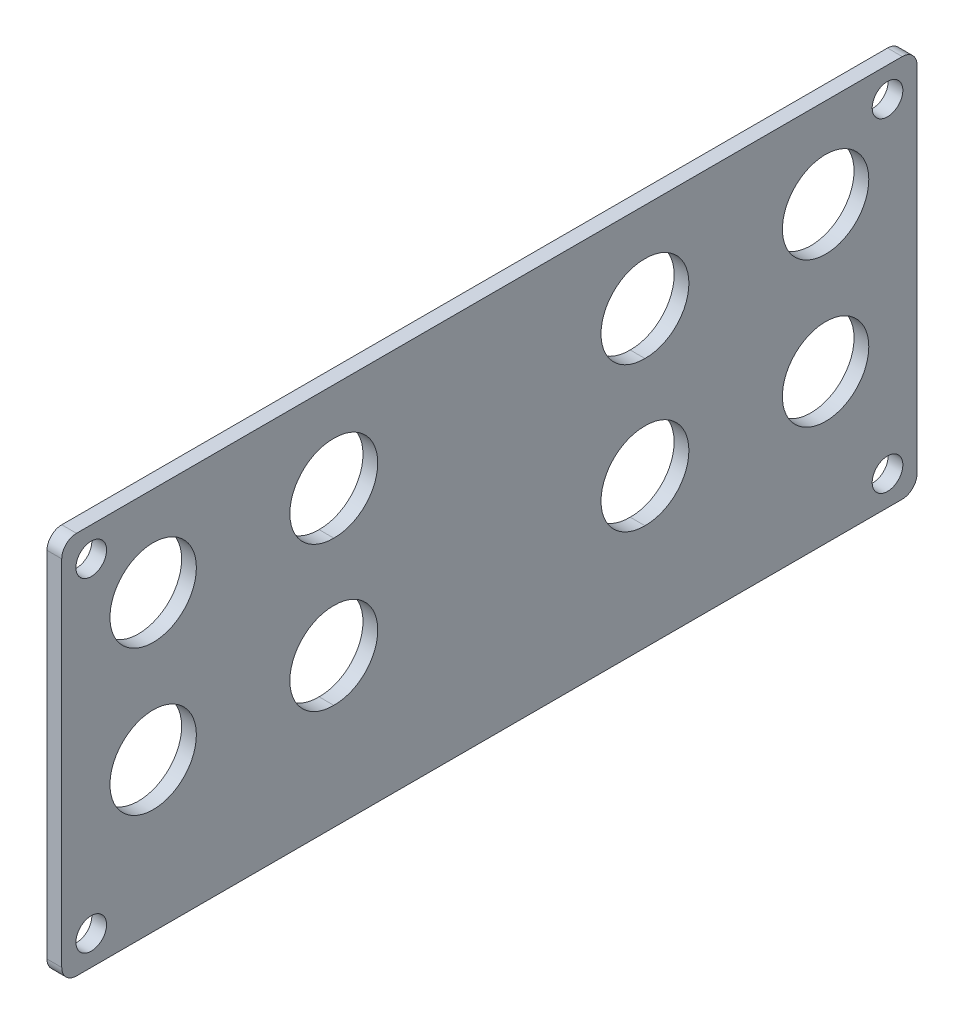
ISO-10303-21;
HEADER;
FILE_DESCRIPTION(('STEP AP214'),'2;1');
FILE_NAME('part.step','',(''),(''),'','','');
FILE_SCHEMA(('AUTOMOTIVE_DESIGN { 1 0 10303 214 1 1 1 1 }'));
ENDSEC;
DATA;
#1=APPLICATION_CONTEXT('core data for automotive mechanical design processes');
#2=APPLICATION_PROTOCOL_DEFINITION('international standard','automotive_design',2000,#1);
#3=PRODUCT_CONTEXT('',#1,'mechanical');
#4=PRODUCT('Part','Part','',(#3));
#5=PRODUCT_RELATED_PRODUCT_CATEGORY('part','',(#4));
#6=PRODUCT_DEFINITION_FORMATION('','',#4);
#7=PRODUCT_DEFINITION_CONTEXT('part definition',#1,'design');
#8=PRODUCT_DEFINITION('design','',#6,#7);
#9=PRODUCT_DEFINITION_SHAPE('','',#8);
#10=(LENGTH_UNIT() NAMED_UNIT(*) SI_UNIT(.MILLI.,.METRE.));
#11=(NAMED_UNIT(*) PLANE_ANGLE_UNIT() SI_UNIT($,.RADIAN.));
#12=(NAMED_UNIT(*) SI_UNIT($,.STERADIAN.) SOLID_ANGLE_UNIT());
#13=UNCERTAINTY_MEASURE_WITH_UNIT(LENGTH_MEASURE(1.E-05),#10,'distance_accuracy_value','');
#14=(GEOMETRIC_REPRESENTATION_CONTEXT(3) GLOBAL_UNCERTAINTY_ASSIGNED_CONTEXT((#13)) GLOBAL_UNIT_ASSIGNED_CONTEXT((#10,
#11,#12)) REPRESENTATION_CONTEXT('',''));
#15=CARTESIAN_POINT('',(0.,0.,0.));
#16=DIRECTION('',(0.,0.,1.));
#17=DIRECTION('',(1.,0.,0.));
#18=AXIS2_PLACEMENT_3D('',#15,#16,#17);
#19=CARTESIAN_POINT('',(-33.450675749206,0.,0.));
#20=DIRECTION('',(1.,0.,0.));
#21=DIRECTION('',(0.,0.,-1.));
#22=AXIS2_PLACEMENT_3D('',#19,#20,#21);
#23=PLANE('',#22);
#24=CARTESIAN_POINT('',(-33.450675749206,-61.389219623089,-21.0448330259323));
#25=DIRECTION('',(-1.,0.,0.));
#26=DIRECTION('',(0.,0.,1.));
#27=AXIS2_PLACEMENT_3D('',#24,#25,#26);
#28=CIRCLE('',#27,3.7211);
#29=CARTESIAN_POINT('',(-33.450675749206,-57.6686614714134,-20.9813330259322));
#30=VERTEX_POINT('',#29);
#31=CARTESIAN_POINT('',(-33.450675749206,-65.1097777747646,-20.9813330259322));
#32=VERTEX_POINT('',#31);
#33=EDGE_CURVE('E164',#30,#32,#28,.T.);
#34=ORIENTED_EDGE('',*,*,#33,.F.);
#35=CARTESIAN_POINT('',(-33.450675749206,-61.389219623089,-20.917833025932));
#36=DIRECTION('',(1.,0.,0.));
#37=DIRECTION('',(0.,0.,-1.));
#38=AXIS2_PLACEMENT_3D('',#35,#36,#37);
#39=CIRCLE('',#38,3.7211);
#40=EDGE_CURVE('E172',#30,#32,#39,.T.);
#41=ORIENTED_EDGE('',*,*,#40,.T.);
#42=EDGE_LOOP('',(#34,#41));
#43=FACE_BOUND('',#42,.T.);
#44=CARTESIAN_POINT('',(-33.450675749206,-48.917819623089,-47.8418330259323));
#45=DIRECTION('',(-1.,0.,0.));
#46=DIRECTION('',(0.,0.,1.));
#47=AXIS2_PLACEMENT_3D('',#44,#45,#46);
#48=CIRCLE('',#47,3.7211);
#49=CARTESIAN_POINT('',(-33.450675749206,-45.1972614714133,-47.7783330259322));
#50=VERTEX_POINT('',#49);
#51=CARTESIAN_POINT('',(-33.450675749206,-52.6383777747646,-47.7783330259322));
#52=VERTEX_POINT('',#51);
#53=EDGE_CURVE('E64',#50,#52,#48,.T.);
#54=ORIENTED_EDGE('',*,*,#53,.F.);
#55=CARTESIAN_POINT('',(-33.450675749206,-48.917819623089,-47.714833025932));
#56=DIRECTION('',(1.,0.,0.));
#57=DIRECTION('',(0.,0.,-1.));
#58=AXIS2_PLACEMENT_3D('',#55,#56,#57);
#59=CIRCLE('',#58,3.7211);
#60=EDGE_CURVE('E369',#50,#52,#59,.T.);
#61=ORIENTED_EDGE('',*,*,#60,.T.);
#62=EDGE_LOOP('',(#54,#61));
#63=FACE_BOUND('',#62,.T.);
#64=CARTESIAN_POINT('',(-33.450675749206,-48.917819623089,-63.335833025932));
#65=DIRECTION('',(1.,0.,0.));
#66=DIRECTION('',(0.,0.,-1.));
#67=AXIS2_PLACEMENT_3D('',#64,#65,#66);
#68=CIRCLE('',#67,3.7211);
#69=CARTESIAN_POINT('',(-33.450675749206,-48.917819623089,-67.056933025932));
#70=VERTEX_POINT('',#69);
#71=EDGE_CURVE('E361',#70,#70,#68,.T.);
#72=ORIENTED_EDGE('',*,*,#71,.T.);
#73=EDGE_LOOP('',(#72));
#74=FACE_BOUND('',#73,.T.);
#75=CARTESIAN_POINT('',(-33.450675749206,-61.389219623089,-5.42383302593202));
#76=DIRECTION('',(1.,0.,0.));
#77=DIRECTION('',(0.,0.,-1.));
#78=AXIS2_PLACEMENT_3D('',#75,#76,#77);
#79=CIRCLE('',#78,3.7211);
#80=CARTESIAN_POINT('',(-33.450675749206,-61.389219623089,-9.14493302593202));
#81=VERTEX_POINT('',#80);
#82=EDGE_CURVE('E179',#81,#81,#79,.T.);
#83=ORIENTED_EDGE('',*,*,#82,.T.);
#84=EDGE_LOOP('',(#83));
#85=FACE_BOUND('',#84,.T.);
#86=CARTESIAN_POINT('',(-33.450675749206,-48.917819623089,-5.42383302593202));
#87=DIRECTION('',(1.,0.,0.));
#88=DIRECTION('',(0.,0.,-1.));
#89=AXIS2_PLACEMENT_3D('',#86,#87,#88);
#90=CIRCLE('',#89,3.7211);
#91=CARTESIAN_POINT('',(-33.450675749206,-48.917819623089,-9.14493302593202));
#92=VERTEX_POINT('',#91);
#93=EDGE_CURVE('E344',#92,#92,#90,.T.);
#94=ORIENTED_EDGE('',*,*,#93,.T.);
#95=EDGE_LOOP('',(#94));
#96=FACE_BOUND('',#95,.T.);
#97=CARTESIAN_POINT('',(-33.450675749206,-61.389219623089,-63.335833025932));
#98=DIRECTION('',(1.,0.,0.));
#99=DIRECTION('',(0.,0.,-1.));
#100=AXIS2_PLACEMENT_3D('',#97,#98,#99);
#101=CIRCLE('',#100,3.7211);
#102=CARTESIAN_POINT('',(-33.450675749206,-61.389219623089,-67.056933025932));
#103=VERTEX_POINT('',#102);
#104=EDGE_CURVE('E190',#103,#103,#101,.T.);
#105=ORIENTED_EDGE('',*,*,#104,.T.);
#106=EDGE_LOOP('',(#105));
#107=FACE_BOUND('',#106,.T.);
#108=CARTESIAN_POINT('',(-33.450675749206,-71.676219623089,-0.0898330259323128));
#109=DIRECTION('',(1.,0.,0.));
#110=DIRECTION('',(0.,0.,1.));
#111=AXIS2_PLACEMENT_3D('',#108,#109,#110);
#112=CIRCLE('',#111,1.32079999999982);
#113=CARTESIAN_POINT('',(-33.450675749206,-71.676219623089,1.2309669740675));
#114=VERTEX_POINT('',#113);
#115=EDGE_CURVE('E200',#114,#114,#112,.T.);
#116=ORIENTED_EDGE('',*,*,#115,.T.);
#117=EDGE_LOOP('',(#116));
#118=FACE_BOUND('',#117,.T.);
#119=CARTESIAN_POINT('',(-33.450675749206,-43.736219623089,-0.0898330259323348));
#120=DIRECTION('',(1.,0.,0.));
#121=DIRECTION('',(0.,0.,1.));
#122=AXIS2_PLACEMENT_3D('',#119,#120,#121);
#123=CIRCLE('',#122,1.3207999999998);
#124=CARTESIAN_POINT('',(-33.450675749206,-43.736219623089,1.23096697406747));
#125=VERTEX_POINT('',#124);
#126=EDGE_CURVE('E208',#125,#125,#123,.T.);
#127=ORIENTED_EDGE('',*,*,#126,.T.);
#128=EDGE_LOOP('',(#127));
#129=FACE_BOUND('',#128,.T.);
#130=CARTESIAN_POINT('',(-33.450675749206,-43.736219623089,-68.669833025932));
#131=DIRECTION('',(1.,0.,0.));
#132=DIRECTION('',(0.,0.,1.));
#133=AXIS2_PLACEMENT_3D('',#130,#131,#132);
#134=CIRCLE('',#133,1.32079999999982);
#135=CARTESIAN_POINT('',(-33.450675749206,-43.736219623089,-67.3490330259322));
#136=VERTEX_POINT('',#135);
#137=EDGE_CURVE('E216',#136,#136,#134,.T.);
#138=ORIENTED_EDGE('',*,*,#137,.T.);
#139=EDGE_LOOP('',(#138));
#140=FACE_BOUND('',#139,.T.);
#141=CARTESIAN_POINT('',(-33.450675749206,-71.676219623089,-68.669833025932));
#142=DIRECTION('',(1.,0.,0.));
#143=DIRECTION('',(0.,0.,1.));
#144=AXIS2_PLACEMENT_3D('',#141,#142,#143);
#145=CIRCLE('',#144,1.32079999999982);
#146=CARTESIAN_POINT('',(-33.450675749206,-71.676219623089,-67.3490330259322));
#147=VERTEX_POINT('',#146);
#148=EDGE_CURVE('E224',#147,#147,#145,.T.);
#149=ORIENTED_EDGE('',*,*,#148,.T.);
#150=EDGE_LOOP('',(#149));
#151=FACE_BOUND('',#150,.T.);
#152=DIRECTION('',(0.,0.,-1.));
#153=VECTOR('',#152,1.);
#154=CARTESIAN_POINT('',(-33.450675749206,-74.216219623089,2.45016697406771));
#155=LINE('',#154,#153);
#156=CARTESIAN_POINT('',(-33.450675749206,-74.216219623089,1.18016697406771));
#157=VERTEX_POINT('',#156);
#158=CARTESIAN_POINT('',(-33.450675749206,-74.216219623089,-69.939833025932));
#159=VERTEX_POINT('',#158);
#160=EDGE_CURVE('E245',#157,#159,#155,.T.);
#161=ORIENTED_EDGE('',*,*,#160,.F.);
#162=CARTESIAN_POINT('',(-33.450675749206,-72.946219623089,1.18016697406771));
#163=DIRECTION('',(1.,0.,0.));
#164=DIRECTION('',(0.,0.,-1.));
#165=AXIS2_PLACEMENT_3D('',#162,#163,#164);
#166=CIRCLE('',#165,1.27);
#167=CARTESIAN_POINT('',(-33.450675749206,-72.946219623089,2.45016697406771));
#168=VERTEX_POINT('',#167);
#169=EDGE_CURVE('E298',#157,#168,#166,.F.);
#170=ORIENTED_EDGE('',*,*,#169,.T.);
#171=DIRECTION('',(0.,-1.,0.));
#172=VECTOR('',#171,1.);
#173=CARTESIAN_POINT('',(-33.450675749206,-41.196219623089,2.45016697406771));
#174=LINE('',#173,#172);
#175=CARTESIAN_POINT('',(-33.450675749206,-42.466219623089,2.45016697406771));
#176=VERTEX_POINT('',#175);
#177=EDGE_CURVE('E241',#176,#168,#174,.T.);
#178=ORIENTED_EDGE('',*,*,#177,.F.);
#179=CARTESIAN_POINT('',(-33.450675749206,-42.466219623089,1.18016697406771));
#180=DIRECTION('',(1.,0.,0.));
#181=DIRECTION('',(0.,0.,-1.));
#182=AXIS2_PLACEMENT_3D('',#179,#180,#181);
#183=CIRCLE('',#182,1.27);
#184=CARTESIAN_POINT('',(-33.450675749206,-41.196219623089,1.18016697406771));
#185=VERTEX_POINT('',#184);
#186=EDGE_CURVE('E292',#176,#185,#183,.F.);
#187=ORIENTED_EDGE('',*,*,#186,.T.);
#188=DIRECTION('',(0.,0.,1.));
#189=VECTOR('',#188,1.);
#190=CARTESIAN_POINT('',(-33.450675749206,-41.196219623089,-71.209833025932));
#191=LINE('',#190,#189);
#192=CARTESIAN_POINT('',(-33.450675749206,-41.196219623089,-69.939833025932));
#193=VERTEX_POINT('',#192);
#194=EDGE_CURVE('E236',#193,#185,#191,.T.);
#195=ORIENTED_EDGE('',*,*,#194,.F.);
#196=CARTESIAN_POINT('',(-33.450675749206,-42.466219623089,-69.939833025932));
#197=DIRECTION('',(1.,0.,0.));
#198=DIRECTION('',(0.,0.,-1.));
#199=AXIS2_PLACEMENT_3D('',#196,#197,#198);
#200=CIRCLE('',#199,1.27);
#201=CARTESIAN_POINT('',(-33.450675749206,-42.466219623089,-71.209833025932));
#202=VERTEX_POINT('',#201);
#203=EDGE_CURVE('E289',#193,#202,#200,.F.);
#204=ORIENTED_EDGE('',*,*,#203,.T.);
#205=DIRECTION('',(0.,1.,0.));
#206=VECTOR('',#205,1.);
#207=CARTESIAN_POINT('',(-33.450675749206,-74.216219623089,-71.209833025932));
#208=LINE('',#207,#206);
#209=CARTESIAN_POINT('',(-33.450675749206,-72.946219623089,-71.209833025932));
#210=VERTEX_POINT('',#209);
#211=EDGE_CURVE('E232',#210,#202,#208,.T.);
#212=ORIENTED_EDGE('',*,*,#211,.F.);
#213=CARTESIAN_POINT('',(-33.450675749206,-72.946219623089,-69.939833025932));
#214=DIRECTION('',(1.,0.,0.));
#215=DIRECTION('',(0.,0.,-1.));
#216=AXIS2_PLACEMENT_3D('',#213,#214,#215);
#217=CIRCLE('',#216,1.27);
#218=EDGE_CURVE('E295',#210,#159,#217,.F.);
#219=ORIENTED_EDGE('',*,*,#218,.T.);
#220=EDGE_LOOP('',(#161,#170,#178,#187,#195,#204,#212,#219));
#221=FACE_BOUND('',#220,.T.);
#222=CARTESIAN_POINT('',(-33.450675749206,-48.917819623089,-21.0448330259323));
#223=DIRECTION('',(-1.,0.,0.));
#224=DIRECTION('',(0.,0.,1.));
#225=AXIS2_PLACEMENT_3D('',#222,#223,#224);
#226=CIRCLE('',#225,3.7211);
#227=CARTESIAN_POINT('',(-33.450675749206,-45.1972614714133,-20.9813330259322));
#228=VERTEX_POINT('',#227);
#229=CARTESIAN_POINT('',(-33.450675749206,-52.6383777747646,-20.9813330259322));
#230=VERTEX_POINT('',#229);
#231=EDGE_CURVE('E56',#228,#230,#226,.T.);
#232=ORIENTED_EDGE('',*,*,#231,.F.);
#233=CARTESIAN_POINT('',(-33.450675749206,-48.917819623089,-20.917833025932));
#234=DIRECTION('',(1.,0.,0.));
#235=DIRECTION('',(0.,0.,-1.));
#236=AXIS2_PLACEMENT_3D('',#233,#234,#235);
#237=CIRCLE('',#236,3.7211);
#238=EDGE_CURVE('E343',#228,#230,#237,.T.);
#239=ORIENTED_EDGE('',*,*,#238,.T.);
#240=EDGE_LOOP('',(#232,#239));
#241=FACE_BOUND('',#240,.T.);
#242=CARTESIAN_POINT('',(-33.450675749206,-61.389219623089,-47.8418330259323));
#243=DIRECTION('',(-1.,0.,0.));
#244=DIRECTION('',(0.,0.,1.));
#245=AXIS2_PLACEMENT_3D('',#242,#243,#244);
#246=CIRCLE('',#245,3.7211);
#247=CARTESIAN_POINT('',(-33.450675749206,-57.6686614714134,-47.7783330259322));
#248=VERTEX_POINT('',#247);
#249=CARTESIAN_POINT('',(-33.450675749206,-65.1097777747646,-47.7783330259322));
#250=VERTEX_POINT('',#249);
#251=EDGE_CURVE('E165',#248,#250,#246,.T.);
#252=ORIENTED_EDGE('',*,*,#251,.F.);
#253=CARTESIAN_POINT('',(-33.450675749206,-61.389219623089,-47.714833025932));
#254=DIRECTION('',(1.,0.,0.));
#255=DIRECTION('',(0.,0.,-1.));
#256=AXIS2_PLACEMENT_3D('',#253,#254,#255);
#257=CIRCLE('',#256,3.7211);
#258=EDGE_CURVE('E199',#248,#250,#257,.T.);
#259=ORIENTED_EDGE('',*,*,#258,.T.);
#260=EDGE_LOOP('',(#252,#259));
#261=FACE_BOUND('',#260,.T.);
#262=ADVANCED_FACE('F41',(#43,#63,#74,#85,#96,#107,#118,#129,#140,#151,#221,#241,#261),#23,.F.);
#263=CARTESIAN_POINT('',(-32.180675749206,0.,0.));
#264=DIRECTION('',(1.,0.,0.));
#265=DIRECTION('',(0.,0.,-1.));
#266=AXIS2_PLACEMENT_3D('',#263,#264,#265);
#267=PLANE('',#266);
#268=CARTESIAN_POINT('',(-32.180675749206,-48.917819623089,-63.335833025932));
#269=DIRECTION('',(1.,0.,0.));
#270=DIRECTION('',(0.,0.,-1.));
#271=AXIS2_PLACEMENT_3D('',#268,#269,#270);
#272=CIRCLE('',#271,3.7211);
#273=CARTESIAN_POINT('',(-32.180675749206,-48.917819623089,-67.056933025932));
#274=VERTEX_POINT('',#273);
#275=EDGE_CURVE('E365',#274,#274,#272,.T.);
#276=ORIENTED_EDGE('',*,*,#275,.F.);
#277=EDGE_LOOP('',(#276));
#278=FACE_BOUND('',#277,.T.);
#279=CARTESIAN_POINT('',(-32.180675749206,-61.389219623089,-5.42383302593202));
#280=DIRECTION('',(1.,0.,0.));
#281=DIRECTION('',(0.,0.,-1.));
#282=AXIS2_PLACEMENT_3D('',#279,#280,#281);
#283=CIRCLE('',#282,3.7211);
#284=CARTESIAN_POINT('',(-32.180675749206,-61.389219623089,-9.14493302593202));
#285=VERTEX_POINT('',#284);
#286=EDGE_CURVE('E186',#285,#285,#283,.T.);
#287=ORIENTED_EDGE('',*,*,#286,.F.);
#288=EDGE_LOOP('',(#287));
#289=FACE_BOUND('',#288,.T.);
#290=CARTESIAN_POINT('',(-32.180675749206,-48.917819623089,-5.42383302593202));
#291=DIRECTION('',(1.,0.,0.));
#292=DIRECTION('',(0.,0.,-1.));
#293=AXIS2_PLACEMENT_3D('',#290,#291,#292);
#294=CIRCLE('',#293,3.7211);
#295=CARTESIAN_POINT('',(-32.180675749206,-48.917819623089,-9.14493302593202));
#296=VERTEX_POINT('',#295);
#297=EDGE_CURVE('E351',#296,#296,#294,.T.);
#298=ORIENTED_EDGE('',*,*,#297,.F.);
#299=EDGE_LOOP('',(#298));
#300=FACE_BOUND('',#299,.T.);
#301=CARTESIAN_POINT('',(-32.180675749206,-61.389219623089,-63.335833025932));
#302=DIRECTION('',(1.,0.,0.));
#303=DIRECTION('',(0.,0.,-1.));
#304=AXIS2_PLACEMENT_3D('',#301,#302,#303);
#305=CIRCLE('',#304,3.7211);
#306=CARTESIAN_POINT('',(-32.180675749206,-61.389219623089,-67.056933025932));
#307=VERTEX_POINT('',#306);
#308=EDGE_CURVE('E195',#307,#307,#305,.T.);
#309=ORIENTED_EDGE('',*,*,#308,.F.);
#310=EDGE_LOOP('',(#309));
#311=FACE_BOUND('',#310,.T.);
#312=CARTESIAN_POINT('',(-32.180675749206,-71.676219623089,-0.0898330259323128));
#313=DIRECTION('',(1.,0.,0.));
#314=DIRECTION('',(0.,0.,1.));
#315=AXIS2_PLACEMENT_3D('',#312,#313,#314);
#316=CIRCLE('',#315,1.32079999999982);
#317=CARTESIAN_POINT('',(-32.180675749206,-71.676219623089,1.2309669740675));
#318=VERTEX_POINT('',#317);
#319=EDGE_CURVE('E194',#318,#318,#316,.T.);
#320=ORIENTED_EDGE('',*,*,#319,.F.);
#321=EDGE_LOOP('',(#320));
#322=FACE_BOUND('',#321,.T.);
#323=CARTESIAN_POINT('',(-32.180675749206,-43.736219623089,-0.0898330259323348));
#324=DIRECTION('',(1.,0.,0.));
#325=DIRECTION('',(0.,0.,1.));
#326=AXIS2_PLACEMENT_3D('',#323,#324,#325);
#327=CIRCLE('',#326,1.3207999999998);
#328=CARTESIAN_POINT('',(-32.180675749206,-43.736219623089,1.23096697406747));
#329=VERTEX_POINT('',#328);
#330=EDGE_CURVE('E204',#329,#329,#327,.T.);
#331=ORIENTED_EDGE('',*,*,#330,.F.);
#332=EDGE_LOOP('',(#331));
#333=FACE_BOUND('',#332,.T.);
#334=CARTESIAN_POINT('',(-32.180675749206,-43.736219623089,-68.669833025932));
#335=DIRECTION('',(1.,0.,0.));
#336=DIRECTION('',(0.,0.,1.));
#337=AXIS2_PLACEMENT_3D('',#334,#335,#336);
#338=CIRCLE('',#337,1.32079999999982);
#339=CARTESIAN_POINT('',(-32.180675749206,-43.736219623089,-67.3490330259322));
#340=VERTEX_POINT('',#339);
#341=EDGE_CURVE('E212',#340,#340,#338,.T.);
#342=ORIENTED_EDGE('',*,*,#341,.F.);
#343=EDGE_LOOP('',(#342));
#344=FACE_BOUND('',#343,.T.);
#345=CARTESIAN_POINT('',(-32.180675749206,-71.676219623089,-68.669833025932));
#346=DIRECTION('',(1.,0.,0.));
#347=DIRECTION('',(0.,0.,1.));
#348=AXIS2_PLACEMENT_3D('',#345,#346,#347);
#349=CIRCLE('',#348,1.32079999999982);
#350=CARTESIAN_POINT('',(-32.180675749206,-71.676219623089,-67.3490330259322));
#351=VERTEX_POINT('',#350);
#352=EDGE_CURVE('E220',#351,#351,#349,.T.);
#353=ORIENTED_EDGE('',*,*,#352,.F.);
#354=EDGE_LOOP('',(#353));
#355=FACE_BOUND('',#354,.T.);
#356=DIRECTION('',(0.,-1.,0.));
#357=VECTOR('',#356,1.);
#358=CARTESIAN_POINT('',(-32.180675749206,-41.196219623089,2.45016697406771));
#359=LINE('',#358,#357);
#360=CARTESIAN_POINT('',(-32.180675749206,-42.466219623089,2.45016697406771));
#361=VERTEX_POINT('',#360);
#362=CARTESIAN_POINT('',(-32.180675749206,-72.946219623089,2.45016697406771));
#363=VERTEX_POINT('',#362);
#364=EDGE_CURVE('E257',#361,#363,#359,.T.);
#365=ORIENTED_EDGE('',*,*,#364,.T.);
#366=CARTESIAN_POINT('',(-32.180675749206,-72.946219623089,1.18016697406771));
#367=DIRECTION('',(1.,0.,0.));
#368=DIRECTION('',(0.,0.,-1.));
#369=AXIS2_PLACEMENT_3D('',#366,#367,#368);
#370=CIRCLE('',#369,1.27);
#371=CARTESIAN_POINT('',(-32.180675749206,-74.216219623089,1.18016697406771));
#372=VERTEX_POINT('',#371);
#373=EDGE_CURVE('E279',#363,#372,#370,.T.);
#374=ORIENTED_EDGE('',*,*,#373,.T.);
#375=DIRECTION('',(0.,0.,-1.));
#376=VECTOR('',#375,1.);
#377=CARTESIAN_POINT('',(-32.180675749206,-74.216219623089,2.45016697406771));
#378=LINE('',#377,#376);
#379=CARTESIAN_POINT('',(-32.180675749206,-74.216219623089,-69.939833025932));
#380=VERTEX_POINT('',#379);
#381=EDGE_CURVE('E237',#372,#380,#378,.T.);
#382=ORIENTED_EDGE('',*,*,#381,.T.);
#383=CARTESIAN_POINT('',(-32.180675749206,-72.946219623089,-69.939833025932));
#384=DIRECTION('',(1.,0.,0.));
#385=DIRECTION('',(0.,0.,-1.));
#386=AXIS2_PLACEMENT_3D('',#383,#384,#385);
#387=CIRCLE('',#386,1.27);
#388=CARTESIAN_POINT('',(-32.180675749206,-72.946219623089,-71.209833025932));
#389=VERTEX_POINT('',#388);
#390=EDGE_CURVE('E276',#380,#389,#387,.T.);
#391=ORIENTED_EDGE('',*,*,#390,.T.);
#392=DIRECTION('',(0.,1.,0.));
#393=VECTOR('',#392,1.);
#394=CARTESIAN_POINT('',(-32.180675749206,-74.216219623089,-71.209833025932));
#395=LINE('',#394,#393);
#396=CARTESIAN_POINT('',(-32.180675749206,-42.466219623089,-71.209833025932));
#397=VERTEX_POINT('',#396);
#398=EDGE_CURVE('E228',#389,#397,#395,.T.);
#399=ORIENTED_EDGE('',*,*,#398,.T.);
#400=CARTESIAN_POINT('',(-32.180675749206,-42.466219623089,-69.939833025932));
#401=DIRECTION('',(1.,0.,0.));
#402=DIRECTION('',(0.,0.,-1.));
#403=AXIS2_PLACEMENT_3D('',#400,#401,#402);
#404=CIRCLE('',#403,1.27);
#405=CARTESIAN_POINT('',(-32.180675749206,-41.196219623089,-69.939833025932));
#406=VERTEX_POINT('',#405);
#407=EDGE_CURVE('E270',#397,#406,#404,.T.);
#408=ORIENTED_EDGE('',*,*,#407,.T.);
#409=DIRECTION('',(0.,0.,1.));
#410=VECTOR('',#409,1.);
#411=CARTESIAN_POINT('',(-32.180675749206,-41.196219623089,-71.209833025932));
#412=LINE('',#411,#410);
#413=CARTESIAN_POINT('',(-32.180675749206,-41.196219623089,1.18016697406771));
#414=VERTEX_POINT('',#413);
#415=EDGE_CURVE('E253',#406,#414,#412,.T.);
#416=ORIENTED_EDGE('',*,*,#415,.T.);
#417=CARTESIAN_POINT('',(-32.180675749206,-42.466219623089,1.18016697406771));
#418=DIRECTION('',(1.,0.,0.));
#419=DIRECTION('',(0.,0.,-1.));
#420=AXIS2_PLACEMENT_3D('',#417,#418,#419);
#421=CIRCLE('',#420,1.27);
#422=EDGE_CURVE('E273',#414,#361,#421,.T.);
#423=ORIENTED_EDGE('',*,*,#422,.T.);
#424=EDGE_LOOP('',(#365,#374,#382,#391,#399,#408,#416,#423));
#425=FACE_BOUND('',#424,.T.);
#426=CARTESIAN_POINT('',(-32.180675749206,-48.917819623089,-47.714833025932));
#427=DIRECTION('',(1.,0.,0.));
#428=DIRECTION('',(0.,0.,-1.));
#429=AXIS2_PLACEMENT_3D('',#426,#427,#428);
#430=CIRCLE('',#429,3.7211);
#431=CARTESIAN_POINT('',(-32.180675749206,-45.1972614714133,-47.7783330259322));
#432=VERTEX_POINT('',#431);
#433=CARTESIAN_POINT('',(-32.180675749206,-52.6383777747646,-47.7783330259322));
#434=VERTEX_POINT('',#433);
#435=EDGE_CURVE('E348',#432,#434,#430,.T.);
#436=ORIENTED_EDGE('',*,*,#435,.F.);
#437=CARTESIAN_POINT('',(-32.180675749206,-48.917819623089,-47.8418330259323));
#438=DIRECTION('',(-1.,0.,0.));
#439=DIRECTION('',(0.,0.,1.));
#440=AXIS2_PLACEMENT_3D('',#437,#438,#439);
#441=CIRCLE('',#440,3.7211);
#442=EDGE_CURVE('E401',#432,#434,#441,.T.);
#443=ORIENTED_EDGE('',*,*,#442,.T.);
#444=EDGE_LOOP('',(#436,#443));
#445=FACE_BOUND('',#444,.T.);
#446=CARTESIAN_POINT('',(-32.180675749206,-48.917819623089,-20.917833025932));
#447=DIRECTION('',(1.,0.,0.));
#448=DIRECTION('',(0.,0.,-1.));
#449=AXIS2_PLACEMENT_3D('',#446,#447,#448);
#450=CIRCLE('',#449,3.7211);
#451=CARTESIAN_POINT('',(-32.180675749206,-45.1972614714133,-20.9813330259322));
#452=VERTEX_POINT('',#451);
#453=CARTESIAN_POINT('',(-32.180675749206,-52.6383777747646,-20.9813330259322));
#454=VERTEX_POINT('',#453);
#455=EDGE_CURVE('E338',#452,#454,#450,.T.);
#456=ORIENTED_EDGE('',*,*,#455,.F.);
#457=CARTESIAN_POINT('',(-32.180675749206,-48.917819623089,-21.0448330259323));
#458=DIRECTION('',(-1.,0.,0.));
#459=DIRECTION('',(0.,0.,1.));
#460=AXIS2_PLACEMENT_3D('',#457,#458,#459);
#461=CIRCLE('',#460,3.7211);
#462=EDGE_CURVE('E330',#452,#454,#461,.T.);
#463=ORIENTED_EDGE('',*,*,#462,.T.);
#464=EDGE_LOOP('',(#456,#463));
#465=FACE_BOUND('',#464,.T.);
#466=CARTESIAN_POINT('',(-32.180675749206,-61.389219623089,-20.917833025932));
#467=DIRECTION('',(1.,0.,0.));
#468=DIRECTION('',(0.,0.,-1.));
#469=AXIS2_PLACEMENT_3D('',#466,#467,#468);
#470=CIRCLE('',#469,3.7211);
#471=CARTESIAN_POINT('',(-32.180675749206,-57.6686614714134,-20.9813330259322));
#472=VERTEX_POINT('',#471);
#473=CARTESIAN_POINT('',(-32.180675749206,-65.1097777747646,-20.9813330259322));
#474=VERTEX_POINT('',#473);
#475=EDGE_CURVE('E170',#472,#474,#470,.T.);
#476=ORIENTED_EDGE('',*,*,#475,.F.);
#477=CARTESIAN_POINT('',(-32.180675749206,-61.389219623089,-21.0448330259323));
#478=DIRECTION('',(-1.,0.,0.));
#479=DIRECTION('',(0.,0.,1.));
#480=AXIS2_PLACEMENT_3D('',#477,#478,#479);
#481=CIRCLE('',#480,3.7211);
#482=EDGE_CURVE('E153',#472,#474,#481,.T.);
#483=ORIENTED_EDGE('',*,*,#482,.T.);
#484=EDGE_LOOP('',(#476,#483));
#485=FACE_BOUND('',#484,.T.);
#486=CARTESIAN_POINT('',(-32.180675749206,-61.389219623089,-47.714833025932));
#487=DIRECTION('',(1.,0.,0.));
#488=DIRECTION('',(0.,0.,-1.));
#489=AXIS2_PLACEMENT_3D('',#486,#487,#488);
#490=CIRCLE('',#489,3.7211);
#491=CARTESIAN_POINT('',(-32.180675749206,-57.6686614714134,-47.7783330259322));
#492=VERTEX_POINT('',#491);
#493=CARTESIAN_POINT('',(-32.180675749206,-65.1097777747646,-47.7783330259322));
#494=VERTEX_POINT('',#493);
#495=EDGE_CURVE('E183',#492,#494,#490,.T.);
#496=ORIENTED_EDGE('',*,*,#495,.F.);
#497=CARTESIAN_POINT('',(-32.180675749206,-61.389219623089,-47.8418330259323));
#498=DIRECTION('',(-1.,0.,0.));
#499=DIRECTION('',(0.,0.,1.));
#500=AXIS2_PLACEMENT_3D('',#497,#498,#499);
#501=CIRCLE('',#500,3.7211);
#502=EDGE_CURVE('E381',#492,#494,#501,.T.);
#503=ORIENTED_EDGE('',*,*,#502,.T.);
#504=EDGE_LOOP('',(#496,#503));
#505=FACE_BOUND('',#504,.T.);
#506=ADVANCED_FACE('F176',(#278,#289,#300,#311,#322,#333,#344,#355,#425,#445,#465,#485,#505),
#267,.T.);
#507=CARTESIAN_POINT('',(-33.450675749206,-48.917819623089,-20.917833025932));
#508=DIRECTION('',(1.,0.,0.));
#509=DIRECTION('',(0.,0.,-1.));
#510=AXIS2_PLACEMENT_3D('',#507,#508,#509);
#511=CYLINDRICAL_SURFACE('',#510,3.7211);
#512=DIRECTION('',(1.,0.,0.));
#513=VECTOR('',#512,1.);
#514=CARTESIAN_POINT('',(-32.815675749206,-45.1972614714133,-20.9813330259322));
#515=LINE('',#514,#513);
#516=EDGE_CURVE('E11',#452,#228,#515,.F.);
#517=ORIENTED_EDGE('',*,*,#516,.F.);
#518=ORIENTED_EDGE('',*,*,#455,.T.);
#519=DIRECTION('',(1.,0.,0.));
#520=VECTOR('',#519,1.);
#521=CARTESIAN_POINT('',(-32.815675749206,-52.6383777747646,-20.9813330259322));
#522=LINE('',#521,#520);
#523=EDGE_CURVE('E50',#230,#454,#522,.T.);
#524=ORIENTED_EDGE('',*,*,#523,.F.);
#525=ORIENTED_EDGE('',*,*,#238,.F.);
#526=EDGE_LOOP('',(#517,#518,#524,#525));
#527=FACE_BOUND('',#526,.T.);
#528=ADVANCED_FACE('F341',(#527),#511,.F.);
#529=CARTESIAN_POINT('',(-33.450675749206,-48.917819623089,-47.714833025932));
#530=DIRECTION('',(1.,0.,0.));
#531=DIRECTION('',(0.,0.,-1.));
#532=AXIS2_PLACEMENT_3D('',#529,#530,#531);
#533=CYLINDRICAL_SURFACE('',#532,3.7211);
#534=DIRECTION('',(1.,0.,0.));
#535=VECTOR('',#534,1.);
#536=CARTESIAN_POINT('',(-32.815675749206,-45.1972614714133,-47.7783330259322));
#537=LINE('',#536,#535);
#538=EDGE_CURVE('E325',#432,#50,#537,.F.);
#539=ORIENTED_EDGE('',*,*,#538,.F.);
#540=ORIENTED_EDGE('',*,*,#435,.T.);
#541=DIRECTION('',(1.,0.,0.));
#542=VECTOR('',#541,1.);
#543=CARTESIAN_POINT('',(-32.815675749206,-52.6383777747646,-47.7783330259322));
#544=LINE('',#543,#542);
#545=EDGE_CURVE('E322',#52,#434,#544,.T.);
#546=ORIENTED_EDGE('',*,*,#545,.F.);
#547=ORIENTED_EDGE('',*,*,#60,.F.);
#548=EDGE_LOOP('',(#539,#540,#546,#547));
#549=FACE_BOUND('',#548,.T.);
#550=ADVANCED_FACE('F397',(#549),#533,.F.);
#551=CARTESIAN_POINT('',(-33.450675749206,-61.389219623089,-47.714833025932));
#552=DIRECTION('',(1.,0.,0.));
#553=DIRECTION('',(0.,0.,-1.));
#554=AXIS2_PLACEMENT_3D('',#551,#552,#553);
#555=CYLINDRICAL_SURFACE('',#554,3.7211);
#556=DIRECTION('',(1.,0.,0.));
#557=VECTOR('',#556,1.);
#558=CARTESIAN_POINT('',(-32.815675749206,-57.6686614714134,-47.7783330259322));
#559=LINE('',#558,#557);
#560=EDGE_CURVE('E319',#492,#248,#559,.F.);
#561=ORIENTED_EDGE('',*,*,#560,.F.);
#562=ORIENTED_EDGE('',*,*,#495,.T.);
#563=DIRECTION('',(1.,0.,0.));
#564=VECTOR('',#563,1.);
#565=CARTESIAN_POINT('',(-32.815675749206,-65.1097777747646,-47.7783330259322));
#566=LINE('',#565,#564);
#567=EDGE_CURVE('E174',#250,#494,#566,.T.);
#568=ORIENTED_EDGE('',*,*,#567,.F.);
#569=ORIENTED_EDGE('',*,*,#258,.F.);
#570=EDGE_LOOP('',(#561,#562,#568,#569));
#571=FACE_BOUND('',#570,.T.);
#572=ADVANCED_FACE('F378',(#571),#555,.F.);
#573=CARTESIAN_POINT('',(-33.450675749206,-61.389219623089,-20.917833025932));
#574=DIRECTION('',(1.,0.,0.));
#575=DIRECTION('',(0.,0.,-1.));
#576=AXIS2_PLACEMENT_3D('',#573,#574,#575);
#577=CYLINDRICAL_SURFACE('',#576,3.7211);
#578=DIRECTION('',(1.,0.,0.));
#579=VECTOR('',#578,1.);
#580=CARTESIAN_POINT('',(-32.815675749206,-57.6686614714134,-20.9813330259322));
#581=LINE('',#580,#579);
#582=EDGE_CURVE('E156',#472,#30,#581,.F.);
#583=ORIENTED_EDGE('',*,*,#582,.F.);
#584=ORIENTED_EDGE('',*,*,#475,.T.);
#585=DIRECTION('',(1.,0.,0.));
#586=VECTOR('',#585,1.);
#587=CARTESIAN_POINT('',(-32.815675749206,-65.1097777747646,-20.9813330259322));
#588=LINE('',#587,#586);
#589=EDGE_CURVE('E159',#32,#474,#588,.T.);
#590=ORIENTED_EDGE('',*,*,#589,.F.);
#591=ORIENTED_EDGE('',*,*,#40,.F.);
#592=EDGE_LOOP('',(#583,#584,#590,#591));
#593=FACE_BOUND('',#592,.T.);
#594=ADVANCED_FACE('F169',(#593),#577,.F.);
#595=CARTESIAN_POINT('',(-33.450675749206,-74.216219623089,-71.209833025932));
#596=DIRECTION('',(0.,0.,-1.));
#597=DIRECTION('',(-1.,0.,0.));
#598=AXIS2_PLACEMENT_3D('',#595,#596,#597);
#599=PLANE('',#598);
#600=ORIENTED_EDGE('',*,*,#398,.F.);
#601=DIRECTION('',(1.,0.,0.));
#602=VECTOR('',#601,1.);
#603=CARTESIAN_POINT('',(-33.450675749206,-72.946219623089,-71.209833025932));
#604=LINE('',#603,#602);
#605=EDGE_CURVE('E305',#389,#210,#604,.F.);
#606=ORIENTED_EDGE('',*,*,#605,.T.);
#607=ORIENTED_EDGE('',*,*,#211,.T.);
#608=DIRECTION('',(1.,0.,0.));
#609=VECTOR('',#608,1.);
#610=CARTESIAN_POINT('',(-33.450675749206,-42.466219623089,-71.209833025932));
#611=LINE('',#610,#609);
#612=EDGE_CURVE('E301',#202,#397,#611,.T.);
#613=ORIENTED_EDGE('',*,*,#612,.T.);
#614=EDGE_LOOP('',(#600,#606,#607,#613));
#615=FACE_BOUND('',#614,.T.);
#616=ADVANCED_FACE('F466',(#615),#599,.T.);
#617=CARTESIAN_POINT('',(-33.450675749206,-74.216219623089,2.45016697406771));
#618=DIRECTION('',(0.,-1.,0.));
#619=DIRECTION('',(0.,0.,-1.));
#620=AXIS2_PLACEMENT_3D('',#617,#618,#619);
#621=PLANE('',#620);
#622=ORIENTED_EDGE('',*,*,#381,.F.);
#623=DIRECTION('',(1.,0.,0.));
#624=VECTOR('',#623,1.);
#625=CARTESIAN_POINT('',(-33.450675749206,-74.216219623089,1.18016697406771));
#626=LINE('',#625,#624);
#627=EDGE_CURVE('E286',#372,#157,#626,.F.);
#628=ORIENTED_EDGE('',*,*,#627,.T.);
#629=ORIENTED_EDGE('',*,*,#160,.T.);
#630=DIRECTION('',(1.,0.,0.));
#631=VECTOR('',#630,1.);
#632=CARTESIAN_POINT('',(-33.450675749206,-74.216219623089,-69.939833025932));
#633=LINE('',#632,#631);
#634=EDGE_CURVE('E282',#159,#380,#633,.T.);
#635=ORIENTED_EDGE('',*,*,#634,.T.);
#636=EDGE_LOOP('',(#622,#628,#629,#635));
#637=FACE_BOUND('',#636,.T.);
#638=ADVANCED_FACE('F491',(#637),#621,.T.);
#639=CARTESIAN_POINT('',(-33.450675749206,-41.196219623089,2.45016697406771));
#640=DIRECTION('',(0.,0.,1.));
#641=DIRECTION('',(1.,0.,0.));
#642=AXIS2_PLACEMENT_3D('',#639,#640,#641);
#643=PLANE('',#642);
#644=ORIENTED_EDGE('',*,*,#177,.T.);
#645=DIRECTION('',(1.,0.,0.));
#646=VECTOR('',#645,1.);
#647=CARTESIAN_POINT('',(-33.450675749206,-72.946219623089,2.45016697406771));
#648=LINE('',#647,#646);
#649=EDGE_CURVE('E266',#168,#363,#648,.T.);
#650=ORIENTED_EDGE('',*,*,#649,.T.);
#651=ORIENTED_EDGE('',*,*,#364,.F.);
#652=DIRECTION('',(1.,0.,0.));
#653=VECTOR('',#652,1.);
#654=CARTESIAN_POINT('',(-33.450675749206,-42.466219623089,2.45016697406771));
#655=LINE('',#654,#653);
#656=EDGE_CURVE('E249',#361,#176,#655,.F.);
#657=ORIENTED_EDGE('',*,*,#656,.T.);
#658=EDGE_LOOP('',(#644,#650,#651,#657));
#659=FACE_BOUND('',#658,.T.);
#660=ADVANCED_FACE('F494',(#659),#643,.T.);
#661=CARTESIAN_POINT('',(-33.450675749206,-41.196219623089,-71.209833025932));
#662=DIRECTION('',(0.,1.,0.));
#663=DIRECTION('',(0.,0.,1.));
#664=AXIS2_PLACEMENT_3D('',#661,#662,#663);
#665=PLANE('',#664);
#666=ORIENTED_EDGE('',*,*,#194,.T.);
#667=DIRECTION('',(1.,0.,0.));
#668=VECTOR('',#667,1.);
#669=CARTESIAN_POINT('',(-33.450675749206,-41.196219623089,1.18016697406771));
#670=LINE('',#669,#668);
#671=EDGE_CURVE('E311',#185,#414,#670,.T.);
#672=ORIENTED_EDGE('',*,*,#671,.T.);
#673=ORIENTED_EDGE('',*,*,#415,.F.);
#674=DIRECTION('',(1.,0.,0.));
#675=VECTOR('',#674,1.);
#676=CARTESIAN_POINT('',(-33.450675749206,-41.196219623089,-69.939833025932));
#677=LINE('',#676,#675);
#678=EDGE_CURVE('E308',#406,#193,#677,.F.);
#679=ORIENTED_EDGE('',*,*,#678,.T.);
#680=EDGE_LOOP('',(#666,#672,#673,#679));
#681=FACE_BOUND('',#680,.T.);
#682=ADVANCED_FACE('F485',(#681),#665,.T.);
#683=CARTESIAN_POINT('',(-33.450675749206,-71.676219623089,-68.669833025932));
#684=DIRECTION('',(1.,0.,0.));
#685=DIRECTION('',(0.,0.,-1.));
#686=AXIS2_PLACEMENT_3D('',#683,#684,#685);
#687=CYLINDRICAL_SURFACE('',#686,1.32079999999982);
#688=ORIENTED_EDGE('',*,*,#148,.F.);
#689=EDGE_LOOP('',(#688));
#690=FACE_BOUND('',#689,.T.);
#691=ORIENTED_EDGE('',*,*,#352,.T.);
#692=EDGE_LOOP('',(#691));
#693=FACE_BOUND('',#692,.T.);
#694=ADVANCED_FACE('F482',(#690,#693),#687,.F.);
#695=CARTESIAN_POINT('',(-33.450675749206,-43.736219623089,-68.669833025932));
#696=DIRECTION('',(1.,0.,0.));
#697=DIRECTION('',(0.,0.,-1.));
#698=AXIS2_PLACEMENT_3D('',#695,#696,#697);
#699=CYLINDRICAL_SURFACE('',#698,1.32079999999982);
#700=ORIENTED_EDGE('',*,*,#137,.F.);
#701=EDGE_LOOP('',(#700));
#702=FACE_BOUND('',#701,.T.);
#703=ORIENTED_EDGE('',*,*,#341,.T.);
#704=EDGE_LOOP('',(#703));
#705=FACE_BOUND('',#704,.T.);
#706=ADVANCED_FACE('F478',(#702,#705),#699,.F.);
#707=CARTESIAN_POINT('',(-33.450675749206,-43.736219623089,-0.0898330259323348));
#708=DIRECTION('',(1.,0.,0.));
#709=DIRECTION('',(0.,0.,-1.));
#710=AXIS2_PLACEMENT_3D('',#707,#708,#709);
#711=CYLINDRICAL_SURFACE('',#710,1.3207999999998);
#712=ORIENTED_EDGE('',*,*,#126,.F.);
#713=EDGE_LOOP('',(#712));
#714=FACE_BOUND('',#713,.T.);
#715=ORIENTED_EDGE('',*,*,#330,.T.);
#716=EDGE_LOOP('',(#715));
#717=FACE_BOUND('',#716,.T.);
#718=ADVANCED_FACE('F474',(#714,#717),#711,.F.);
#719=CARTESIAN_POINT('',(-33.450675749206,-71.676219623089,-0.0898330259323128));
#720=DIRECTION('',(1.,0.,0.));
#721=DIRECTION('',(0.,0.,-1.));
#722=AXIS2_PLACEMENT_3D('',#719,#720,#721);
#723=CYLINDRICAL_SURFACE('',#722,1.32079999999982);
#724=ORIENTED_EDGE('',*,*,#115,.F.);
#725=EDGE_LOOP('',(#724));
#726=FACE_BOUND('',#725,.T.);
#727=ORIENTED_EDGE('',*,*,#319,.T.);
#728=EDGE_LOOP('',(#727));
#729=FACE_BOUND('',#728,.T.);
#730=ADVANCED_FACE('F470',(#726,#729),#723,.F.);
#731=CARTESIAN_POINT('',(-33.450675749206,-72.946219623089,1.18016697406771));
#732=DIRECTION('',(1.,0.,0.));
#733=DIRECTION('',(0.,0.,-1.));
#734=AXIS2_PLACEMENT_3D('',#731,#732,#733);
#735=CYLINDRICAL_SURFACE('',#734,1.27);
#736=ORIENTED_EDGE('',*,*,#169,.F.);
#737=ORIENTED_EDGE('',*,*,#627,.F.);
#738=ORIENTED_EDGE('',*,*,#373,.F.);
#739=ORIENTED_EDGE('',*,*,#649,.F.);
#740=EDGE_LOOP('',(#736,#737,#738,#739));
#741=FACE_BOUND('',#740,.T.);
#742=ADVANCED_FACE('F473',(#741),#735,.T.);
#743=CARTESIAN_POINT('',(-33.450675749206,-72.946219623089,-69.939833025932));
#744=DIRECTION('',(1.,0.,0.));
#745=DIRECTION('',(0.,0.,-1.));
#746=AXIS2_PLACEMENT_3D('',#743,#744,#745);
#747=CYLINDRICAL_SURFACE('',#746,1.27);
#748=ORIENTED_EDGE('',*,*,#218,.F.);
#749=ORIENTED_EDGE('',*,*,#605,.F.);
#750=ORIENTED_EDGE('',*,*,#390,.F.);
#751=ORIENTED_EDGE('',*,*,#634,.F.);
#752=EDGE_LOOP('',(#748,#749,#750,#751));
#753=FACE_BOUND('',#752,.T.);
#754=ADVANCED_FACE('F507',(#753),#747,.T.);
#755=CARTESIAN_POINT('',(-33.450675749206,-42.466219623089,1.18016697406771));
#756=DIRECTION('',(1.,0.,0.));
#757=DIRECTION('',(0.,0.,-1.));
#758=AXIS2_PLACEMENT_3D('',#755,#756,#757);
#759=CYLINDRICAL_SURFACE('',#758,1.27);
#760=ORIENTED_EDGE('',*,*,#186,.F.);
#761=ORIENTED_EDGE('',*,*,#656,.F.);
#762=ORIENTED_EDGE('',*,*,#422,.F.);
#763=ORIENTED_EDGE('',*,*,#671,.F.);
#764=EDGE_LOOP('',(#760,#761,#762,#763));
#765=FACE_BOUND('',#764,.T.);
#766=ADVANCED_FACE('F510',(#765),#759,.T.);
#767=CARTESIAN_POINT('',(-33.450675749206,-42.466219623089,-69.939833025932));
#768=DIRECTION('',(1.,0.,0.));
#769=DIRECTION('',(0.,0.,-1.));
#770=AXIS2_PLACEMENT_3D('',#767,#768,#769);
#771=CYLINDRICAL_SURFACE('',#770,1.27);
#772=ORIENTED_EDGE('',*,*,#203,.F.);
#773=ORIENTED_EDGE('',*,*,#678,.F.);
#774=ORIENTED_EDGE('',*,*,#407,.F.);
#775=ORIENTED_EDGE('',*,*,#612,.F.);
#776=EDGE_LOOP('',(#772,#773,#774,#775));
#777=FACE_BOUND('',#776,.T.);
#778=ADVANCED_FACE('F43',(#777),#771,.T.);
#779=CARTESIAN_POINT('',(-33.450675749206,-61.389219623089,-63.335833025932));
#780=DIRECTION('',(1.,0.,0.));
#781=DIRECTION('',(0.,0.,-1.));
#782=AXIS2_PLACEMENT_3D('',#779,#780,#781);
#783=CYLINDRICAL_SURFACE('',#782,3.7211);
#784=ORIENTED_EDGE('',*,*,#104,.F.);
#785=EDGE_LOOP('',(#784));
#786=FACE_BOUND('',#785,.T.);
#787=ORIENTED_EDGE('',*,*,#308,.T.);
#788=EDGE_LOOP('',(#787));
#789=FACE_BOUND('',#788,.T.);
#790=ADVANCED_FACE('F454',(#786,#789),#783,.F.);
#791=CARTESIAN_POINT('',(-33.450675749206,-48.917819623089,-5.42383302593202));
#792=DIRECTION('',(1.,0.,0.));
#793=DIRECTION('',(0.,0.,-1.));
#794=AXIS2_PLACEMENT_3D('',#791,#792,#793);
#795=CYLINDRICAL_SURFACE('',#794,3.7211);
#796=ORIENTED_EDGE('',*,*,#93,.F.);
#797=EDGE_LOOP('',(#796));
#798=FACE_BOUND('',#797,.T.);
#799=ORIENTED_EDGE('',*,*,#297,.T.);
#800=EDGE_LOOP('',(#799));
#801=FACE_BOUND('',#800,.T.);
#802=ADVANCED_FACE('F450',(#798,#801),#795,.F.);
#803=CARTESIAN_POINT('',(-33.450675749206,-61.389219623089,-5.42383302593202));
#804=DIRECTION('',(1.,0.,0.));
#805=DIRECTION('',(0.,0.,-1.));
#806=AXIS2_PLACEMENT_3D('',#803,#804,#805);
#807=CYLINDRICAL_SURFACE('',#806,3.7211);
#808=ORIENTED_EDGE('',*,*,#82,.F.);
#809=EDGE_LOOP('',(#808));
#810=FACE_BOUND('',#809,.T.);
#811=ORIENTED_EDGE('',*,*,#286,.T.);
#812=EDGE_LOOP('',(#811));
#813=FACE_BOUND('',#812,.T.);
#814=ADVANCED_FACE('F453',(#810,#813),#807,.F.);
#815=CARTESIAN_POINT('',(-33.450675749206,-48.917819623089,-63.335833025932));
#816=DIRECTION('',(1.,0.,0.));
#817=DIRECTION('',(0.,0.,-1.));
#818=AXIS2_PLACEMENT_3D('',#815,#816,#817);
#819=CYLINDRICAL_SURFACE('',#818,3.7211);
#820=ORIENTED_EDGE('',*,*,#71,.F.);
#821=EDGE_LOOP('',(#820));
#822=FACE_BOUND('',#821,.T.);
#823=ORIENTED_EDGE('',*,*,#275,.T.);
#824=EDGE_LOOP('',(#823));
#825=FACE_BOUND('',#824,.T.);
#826=ADVANCED_FACE('F443',(#822,#825),#819,.F.);
#827=CARTESIAN_POINT('',(-33.450675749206,-61.389219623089,-21.0448330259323));
#828=DIRECTION('',(1.,0.,0.));
#829=DIRECTION('',(0.,0.,-1.));
#830=AXIS2_PLACEMENT_3D('',#827,#828,#829);
#831=CYLINDRICAL_SURFACE('',#830,3.7211);
#832=ORIENTED_EDGE('',*,*,#582,.T.);
#833=ORIENTED_EDGE('',*,*,#33,.T.);
#834=ORIENTED_EDGE('',*,*,#589,.T.);
#835=ORIENTED_EDGE('',*,*,#482,.F.);
#836=EDGE_LOOP('',(#832,#833,#834,#835));
#837=FACE_BOUND('',#836,.T.);
#838=ADVANCED_FACE('F155',(#837),#831,.F.);
#839=CARTESIAN_POINT('',(-33.450675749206,-61.389219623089,-47.8418330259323));
#840=DIRECTION('',(1.,0.,0.));
#841=DIRECTION('',(0.,0.,-1.));
#842=AXIS2_PLACEMENT_3D('',#839,#840,#841);
#843=CYLINDRICAL_SURFACE('',#842,3.7211);
#844=ORIENTED_EDGE('',*,*,#560,.T.);
#845=ORIENTED_EDGE('',*,*,#251,.T.);
#846=ORIENTED_EDGE('',*,*,#567,.T.);
#847=ORIENTED_EDGE('',*,*,#502,.F.);
#848=EDGE_LOOP('',(#844,#845,#846,#847));
#849=FACE_BOUND('',#848,.T.);
#850=ADVANCED_FACE('F434',(#849),#843,.F.);
#851=CARTESIAN_POINT('',(-33.450675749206,-48.917819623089,-47.8418330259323));
#852=DIRECTION('',(1.,0.,0.));
#853=DIRECTION('',(0.,0.,-1.));
#854=AXIS2_PLACEMENT_3D('',#851,#852,#853);
#855=CYLINDRICAL_SURFACE('',#854,3.7211);
#856=ORIENTED_EDGE('',*,*,#538,.T.);
#857=ORIENTED_EDGE('',*,*,#53,.T.);
#858=ORIENTED_EDGE('',*,*,#545,.T.);
#859=ORIENTED_EDGE('',*,*,#442,.F.);
#860=EDGE_LOOP('',(#856,#857,#858,#859));
#861=FACE_BOUND('',#860,.T.);
#862=ADVANCED_FACE('F436',(#861),#855,.F.);
#863=CARTESIAN_POINT('',(-33.450675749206,-48.917819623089,-21.0448330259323));
#864=DIRECTION('',(1.,0.,0.));
#865=DIRECTION('',(0.,0.,-1.));
#866=AXIS2_PLACEMENT_3D('',#863,#864,#865);
#867=CYLINDRICAL_SURFACE('',#866,3.7211);
#868=ORIENTED_EDGE('',*,*,#516,.T.);
#869=ORIENTED_EDGE('',*,*,#231,.T.);
#870=ORIENTED_EDGE('',*,*,#523,.T.);
#871=ORIENTED_EDGE('',*,*,#462,.F.);
#872=EDGE_LOOP('',(#868,#869,#870,#871));
#873=FACE_BOUND('',#872,.T.);
#874=ADVANCED_FACE('F329',(#873),#867,.F.);
#875=CLOSED_SHELL('',(#262,#506,#528,#550,#572,#594,#616,#638,#660,#682,#694,#706,#718,#730,
#742,#754,#766,#778,#790,#802,#814,#826,#838,#850,#862,#874));
#876=MANIFOLD_SOLID_BREP('B2',#875);
#877=ADVANCED_BREP_SHAPE_REPRESENTATION('',(#18,#876),#14);
#878=SHAPE_DEFINITION_REPRESENTATION(#9,#877);
ENDSEC;
END-ISO-10303-21;
